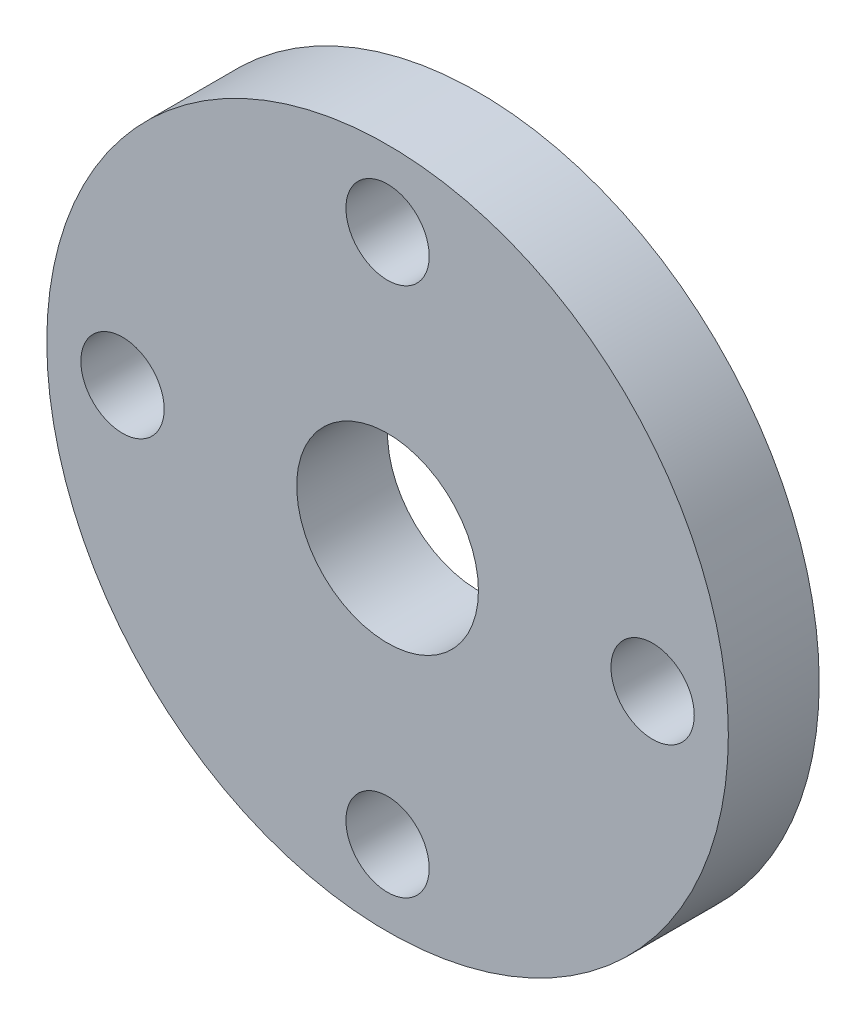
ISO-10303-21;
HEADER;
FILE_DESCRIPTION(('STEP AP214'),'2;1');
FILE_NAME('part.step','',(''),(''),'','','');
FILE_SCHEMA(('AUTOMOTIVE_DESIGN { 1 0 10303 214 1 1 1 1 }'));
ENDSEC;
DATA;
#1=APPLICATION_CONTEXT('core data for automotive mechanical design processes');
#2=APPLICATION_PROTOCOL_DEFINITION('international standard','automotive_design',2000,#1);
#3=PRODUCT_CONTEXT('',#1,'mechanical');
#4=PRODUCT('Part','Part','',(#3));
#5=PRODUCT_RELATED_PRODUCT_CATEGORY('part','',(#4));
#6=PRODUCT_DEFINITION_FORMATION('','',#4);
#7=PRODUCT_DEFINITION_CONTEXT('part definition',#1,'design');
#8=PRODUCT_DEFINITION('design','',#6,#7);
#9=PRODUCT_DEFINITION_SHAPE('','',#8);
#10=(LENGTH_UNIT() NAMED_UNIT(*) SI_UNIT(.MILLI.,.METRE.));
#11=(NAMED_UNIT(*) PLANE_ANGLE_UNIT() SI_UNIT($,.RADIAN.));
#12=(NAMED_UNIT(*) SI_UNIT($,.STERADIAN.) SOLID_ANGLE_UNIT());
#13=UNCERTAINTY_MEASURE_WITH_UNIT(LENGTH_MEASURE(1.E-05),#10,'distance_accuracy_value','');
#14=(GEOMETRIC_REPRESENTATION_CONTEXT(3) GLOBAL_UNCERTAINTY_ASSIGNED_CONTEXT((#13)) GLOBAL_UNIT_ASSIGNED_CONTEXT((#10,
#11,#12)) REPRESENTATION_CONTEXT('',''));
#15=CARTESIAN_POINT('',(0.,0.,0.));
#16=DIRECTION('',(0.,0.,1.));
#17=DIRECTION('',(1.,0.,0.));
#18=AXIS2_PLACEMENT_3D('',#15,#16,#17);
#19=CARTESIAN_POINT('',(0.,0.,6.));
#20=DIRECTION('',(0.,0.,1.));
#21=DIRECTION('',(1.,0.,0.));
#22=AXIS2_PLACEMENT_3D('',#19,#20,#21);
#23=PLANE('',#22);
#24=CARTESIAN_POINT('',(-1.2220184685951E-13,-17.5,6.));
#25=DIRECTION('',(0.,0.,1.));
#26=DIRECTION('',(1.,0.,0.));
#27=AXIS2_PLACEMENT_3D('',#24,#25,#26);
#28=CIRCLE('',#27,2.75);
#29=CARTESIAN_POINT('',(2.74999999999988,-17.5,6.));
#30=VERTEX_POINT('',#29);
#31=EDGE_CURVE('E58',#30,#30,#28,.T.);
#32=ORIENTED_EDGE('',*,*,#31,.F.);
#33=EDGE_LOOP('',(#32));
#34=FACE_BOUND('',#33,.T.);
#35=CARTESIAN_POINT('',(0.,17.5,6.));
#36=DIRECTION('',(0.,0.,1.));
#37=DIRECTION('',(1.,0.,0.));
#38=AXIS2_PLACEMENT_3D('',#35,#36,#37);
#39=CIRCLE('',#38,2.75);
#40=CARTESIAN_POINT('',(2.75,17.5,6.));
#41=VERTEX_POINT('',#40);
#42=EDGE_CURVE('E46',#41,#41,#39,.T.);
#43=ORIENTED_EDGE('',*,*,#42,.F.);
#44=EDGE_LOOP('',(#43));
#45=FACE_BOUND('',#44,.T.);
#46=CARTESIAN_POINT('',(0.,0.,6.));
#47=DIRECTION('',(0.,0.,1.));
#48=DIRECTION('',(1.,0.,0.));
#49=AXIS2_PLACEMENT_3D('',#46,#47,#48);
#50=CIRCLE('',#49,22.5);
#51=CARTESIAN_POINT('',(22.5,0.,6.));
#52=VERTEX_POINT('',#51);
#53=EDGE_CURVE('E10',#52,#52,#50,.T.);
#54=ORIENTED_EDGE('',*,*,#53,.T.);
#55=EDGE_LOOP('',(#54));
#56=FACE_BOUND('',#55,.T.);
#57=CARTESIAN_POINT('',(0.,0.,6.));
#58=DIRECTION('',(0.,0.,1.));
#59=DIRECTION('',(1.,0.,0.));
#60=AXIS2_PLACEMENT_3D('',#57,#58,#59);
#61=CIRCLE('',#60,6.);
#62=CARTESIAN_POINT('',(6.,0.,6.));
#63=VERTEX_POINT('',#62);
#64=EDGE_CURVE('E41',#63,#63,#61,.T.);
#65=ORIENTED_EDGE('',*,*,#64,.F.);
#66=EDGE_LOOP('',(#65));
#67=FACE_BOUND('',#66,.T.);
#68=CARTESIAN_POINT('',(17.5,0.,6.));
#69=DIRECTION('',(0.,0.,1.));
#70=DIRECTION('',(1.,0.,0.));
#71=AXIS2_PLACEMENT_3D('',#68,#69,#70);
#72=CIRCLE('',#71,2.75);
#73=CARTESIAN_POINT('',(20.25,0.,6.));
#74=VERTEX_POINT('',#73);
#75=EDGE_CURVE('E52',#74,#74,#72,.T.);
#76=ORIENTED_EDGE('',*,*,#75,.F.);
#77=EDGE_LOOP('',(#76));
#78=FACE_BOUND('',#77,.T.);
#79=CARTESIAN_POINT('',(-17.5,1.83302770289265E-13,6.));
#80=DIRECTION('',(0.,0.,1.));
#81=DIRECTION('',(1.,0.,0.));
#82=AXIS2_PLACEMENT_3D('',#79,#80,#81);
#83=CIRCLE('',#82,2.75);
#84=CARTESIAN_POINT('',(-14.75,1.83302770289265E-13,6.));
#85=VERTEX_POINT('',#84);
#86=EDGE_CURVE('E64',#85,#85,#83,.T.);
#87=ORIENTED_EDGE('',*,*,#86,.F.);
#88=EDGE_LOOP('',(#87));
#89=FACE_BOUND('',#88,.T.);
#90=ADVANCED_FACE('F30',(#34,#45,#56,#67,#78,#89),#23,.T.);
#91=CARTESIAN_POINT('',(0.,0.,0.));
#92=DIRECTION('',(0.,0.,1.));
#93=DIRECTION('',(1.,0.,0.));
#94=AXIS2_PLACEMENT_3D('',#91,#92,#93);
#95=PLANE('',#94);
#96=CARTESIAN_POINT('',(0.,0.,0.));
#97=DIRECTION('',(0.,0.,1.));
#98=DIRECTION('',(1.,0.,0.));
#99=AXIS2_PLACEMENT_3D('',#96,#97,#98);
#100=CIRCLE('',#99,22.5);
#101=CARTESIAN_POINT('',(22.5,0.,0.));
#102=VERTEX_POINT('',#101);
#103=EDGE_CURVE('E34',#102,#102,#100,.T.);
#104=ORIENTED_EDGE('',*,*,#103,.F.);
#105=EDGE_LOOP('',(#104));
#106=FACE_BOUND('',#105,.T.);
#107=CARTESIAN_POINT('',(0.,0.,0.));
#108=DIRECTION('',(0.,0.,1.));
#109=DIRECTION('',(1.,0.,0.));
#110=AXIS2_PLACEMENT_3D('',#107,#108,#109);
#111=CIRCLE('',#110,6.);
#112=CARTESIAN_POINT('',(6.,0.,0.));
#113=VERTEX_POINT('',#112);
#114=EDGE_CURVE('E43',#113,#113,#111,.T.);
#115=ORIENTED_EDGE('',*,*,#114,.T.);
#116=EDGE_LOOP('',(#115));
#117=FACE_BOUND('',#116,.T.);
#118=CARTESIAN_POINT('',(0.,17.5,0.));
#119=DIRECTION('',(0.,0.,1.));
#120=DIRECTION('',(1.,0.,0.));
#121=AXIS2_PLACEMENT_3D('',#118,#119,#120);
#122=CIRCLE('',#121,2.75);
#123=CARTESIAN_POINT('',(2.75,17.5,0.));
#124=VERTEX_POINT('',#123);
#125=EDGE_CURVE('E49',#124,#124,#122,.T.);
#126=ORIENTED_EDGE('',*,*,#125,.T.);
#127=EDGE_LOOP('',(#126));
#128=FACE_BOUND('',#127,.T.);
#129=CARTESIAN_POINT('',(17.5,0.,0.));
#130=DIRECTION('',(0.,0.,1.));
#131=DIRECTION('',(1.,0.,0.));
#132=AXIS2_PLACEMENT_3D('',#129,#130,#131);
#133=CIRCLE('',#132,2.75);
#134=CARTESIAN_POINT('',(20.25,0.,0.));
#135=VERTEX_POINT('',#134);
#136=EDGE_CURVE('E55',#135,#135,#133,.T.);
#137=ORIENTED_EDGE('',*,*,#136,.T.);
#138=EDGE_LOOP('',(#137));
#139=FACE_BOUND('',#138,.T.);
#140=CARTESIAN_POINT('',(-1.2220184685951E-13,-17.5,0.));
#141=DIRECTION('',(0.,0.,1.));
#142=DIRECTION('',(1.,0.,0.));
#143=AXIS2_PLACEMENT_3D('',#140,#141,#142);
#144=CIRCLE('',#143,2.75);
#145=CARTESIAN_POINT('',(2.74999999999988,-17.5,0.));
#146=VERTEX_POINT('',#145);
#147=EDGE_CURVE('E61',#146,#146,#144,.T.);
#148=ORIENTED_EDGE('',*,*,#147,.T.);
#149=EDGE_LOOP('',(#148));
#150=FACE_BOUND('',#149,.T.);
#151=CARTESIAN_POINT('',(-17.5,1.83302770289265E-13,0.));
#152=DIRECTION('',(0.,0.,1.));
#153=DIRECTION('',(1.,0.,0.));
#154=AXIS2_PLACEMENT_3D('',#151,#152,#153);
#155=CIRCLE('',#154,2.75);
#156=CARTESIAN_POINT('',(-14.75,1.83302770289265E-13,0.));
#157=VERTEX_POINT('',#156);
#158=EDGE_CURVE('E67',#157,#157,#155,.T.);
#159=ORIENTED_EDGE('',*,*,#158,.T.);
#160=EDGE_LOOP('',(#159));
#161=FACE_BOUND('',#160,.T.);
#162=ADVANCED_FACE('F77',(#106,#117,#128,#139,#150,#161),#95,.F.);
#163=CARTESIAN_POINT('',(0.,0.,6.));
#164=DIRECTION('',(0.,0.,-1.));
#165=DIRECTION('',(-1.,0.,0.));
#166=AXIS2_PLACEMENT_3D('',#163,#164,#165);
#167=CYLINDRICAL_SURFACE('',#166,22.5);
#168=ORIENTED_EDGE('',*,*,#53,.F.);
#169=EDGE_LOOP('',(#168));
#170=FACE_BOUND('',#169,.T.);
#171=ORIENTED_EDGE('',*,*,#103,.T.);
#172=EDGE_LOOP('',(#171));
#173=FACE_BOUND('',#172,.T.);
#174=ADVANCED_FACE('F32',(#170,#173),#167,.T.);
#175=CARTESIAN_POINT('',(0.,0.,6.));
#176=DIRECTION('',(0.,0.,-1.));
#177=DIRECTION('',(-1.,0.,0.));
#178=AXIS2_PLACEMENT_3D('',#175,#176,#177);
#179=CYLINDRICAL_SURFACE('',#178,6.);
#180=ORIENTED_EDGE('',*,*,#64,.T.);
#181=EDGE_LOOP('',(#180));
#182=FACE_BOUND('',#181,.T.);
#183=ORIENTED_EDGE('',*,*,#114,.F.);
#184=EDGE_LOOP('',(#183));
#185=FACE_BOUND('',#184,.T.);
#186=ADVANCED_FACE('F87',(#182,#185),#179,.F.);
#187=CARTESIAN_POINT('',(0.,17.5,6.));
#188=DIRECTION('',(0.,0.,-1.));
#189=DIRECTION('',(-1.,0.,0.));
#190=AXIS2_PLACEMENT_3D('',#187,#188,#189);
#191=CYLINDRICAL_SURFACE('',#190,2.75);
#192=ORIENTED_EDGE('',*,*,#42,.T.);
#193=EDGE_LOOP('',(#192));
#194=FACE_BOUND('',#193,.T.);
#195=ORIENTED_EDGE('',*,*,#125,.F.);
#196=EDGE_LOOP('',(#195));
#197=FACE_BOUND('',#196,.T.);
#198=ADVANCED_FACE('F90',(#194,#197),#191,.F.);
#199=CARTESIAN_POINT('',(17.5,0.,6.));
#200=DIRECTION('',(0.,0.,-1.));
#201=DIRECTION('',(-1.,0.,0.));
#202=AXIS2_PLACEMENT_3D('',#199,#200,#201);
#203=CYLINDRICAL_SURFACE('',#202,2.75);
#204=ORIENTED_EDGE('',*,*,#75,.T.);
#205=EDGE_LOOP('',(#204));
#206=FACE_BOUND('',#205,.T.);
#207=ORIENTED_EDGE('',*,*,#136,.F.);
#208=EDGE_LOOP('',(#207));
#209=FACE_BOUND('',#208,.T.);
#210=ADVANCED_FACE('F94',(#206,#209),#203,.F.);
#211=CARTESIAN_POINT('',(-1.2220184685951E-13,-17.5,6.));
#212=DIRECTION('',(0.,0.,-1.));
#213=DIRECTION('',(-1.,0.,0.));
#214=AXIS2_PLACEMENT_3D('',#211,#212,#213);
#215=CYLINDRICAL_SURFACE('',#214,2.75);
#216=ORIENTED_EDGE('',*,*,#31,.T.);
#217=EDGE_LOOP('',(#216));
#218=FACE_BOUND('',#217,.T.);
#219=ORIENTED_EDGE('',*,*,#147,.F.);
#220=EDGE_LOOP('',(#219));
#221=FACE_BOUND('',#220,.T.);
#222=ADVANCED_FACE('F98',(#218,#221),#215,.F.);
#223=CARTESIAN_POINT('',(-17.5,1.83302770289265E-13,6.));
#224=DIRECTION('',(0.,0.,-1.));
#225=DIRECTION('',(-1.,0.,0.));
#226=AXIS2_PLACEMENT_3D('',#223,#224,#225);
#227=CYLINDRICAL_SURFACE('',#226,2.75);
#228=ORIENTED_EDGE('',*,*,#86,.T.);
#229=EDGE_LOOP('',(#228));
#230=FACE_BOUND('',#229,.T.);
#231=ORIENTED_EDGE('',*,*,#158,.F.);
#232=EDGE_LOOP('',(#231));
#233=FACE_BOUND('',#232,.T.);
#234=ADVANCED_FACE('F73',(#230,#233),#227,.F.);
#235=CLOSED_SHELL('',(#90,#162,#174,#186,#198,#210,#222,#234));
#236=MANIFOLD_SOLID_BREP('B2',#235);
#237=ADVANCED_BREP_SHAPE_REPRESENTATION('',(#18,#236),#14);
#238=SHAPE_DEFINITION_REPRESENTATION(#9,#237);
ENDSEC;
END-ISO-10303-21;
